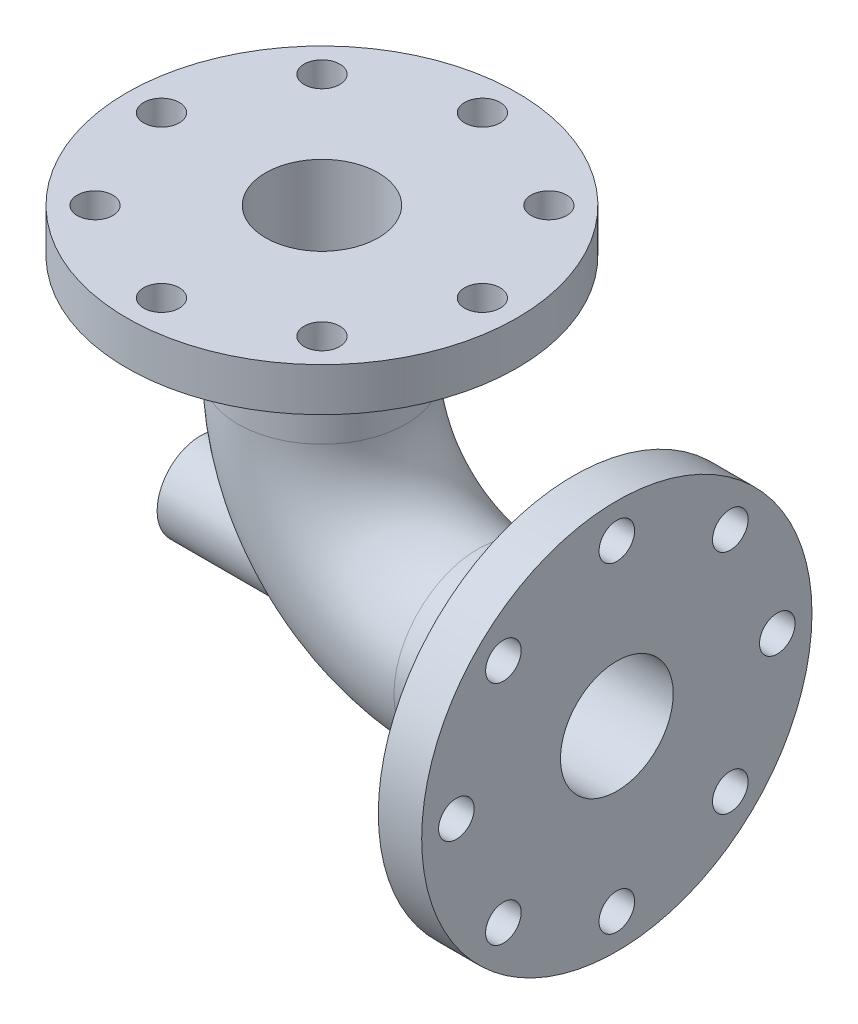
ISO-10303-21;
HEADER;
FILE_DESCRIPTION(('STEP AP214'),'2;1');
FILE_NAME('part.step','',(''),(''),'','','');
FILE_SCHEMA(('AUTOMOTIVE_DESIGN { 1 0 10303 214 1 1 1 1 }'));
ENDSEC;
DATA;
#1=APPLICATION_CONTEXT('core data for automotive mechanical design processes');
#2=APPLICATION_PROTOCOL_DEFINITION('international standard','automotive_design',2000,#1);
#3=PRODUCT_CONTEXT('',#1,'mechanical');
#4=PRODUCT('Part','Part','',(#3));
#5=PRODUCT_RELATED_PRODUCT_CATEGORY('part','',(#4));
#6=PRODUCT_DEFINITION_FORMATION('','',#4);
#7=PRODUCT_DEFINITION_CONTEXT('part definition',#1,'design');
#8=PRODUCT_DEFINITION('design','',#6,#7);
#9=PRODUCT_DEFINITION_SHAPE('','',#8);
#10=(LENGTH_UNIT() NAMED_UNIT(*) SI_UNIT(.MILLI.,.METRE.));
#11=(NAMED_UNIT(*) PLANE_ANGLE_UNIT() SI_UNIT($,.RADIAN.));
#12=(NAMED_UNIT(*) SI_UNIT($,.STERADIAN.) SOLID_ANGLE_UNIT());
#13=UNCERTAINTY_MEASURE_WITH_UNIT(LENGTH_MEASURE(1.E-05),#10,'distance_accuracy_value','');
#14=(GEOMETRIC_REPRESENTATION_CONTEXT(3) GLOBAL_UNCERTAINTY_ASSIGNED_CONTEXT((#13)) GLOBAL_UNIT_ASSIGNED_CONTEXT((#10,
#11,#12)) REPRESENTATION_CONTEXT('',''));
#15=CARTESIAN_POINT('',(0.,0.,0.));
#16=DIRECTION('',(0.,0.,1.));
#17=DIRECTION('',(1.,0.,0.));
#18=AXIS2_PLACEMENT_3D('',#15,#16,#17);
#19=CARTESIAN_POINT('',(0.,0.,0.));
#20=DIRECTION('',(0.,0.,1.));
#21=DIRECTION('',(1.,0.,0.));
#22=AXIS2_PLACEMENT_3D('',#19,#20,#21);
#23=TOROIDAL_SURFACE('',#22,90.,48.5);
#24=CARTESIAN_POINT('',(0.,-90.,0.));
#25=DIRECTION('',(-1.,0.,0.));
#26=DIRECTION('',(0.,0.,1.));
#27=AXIS2_PLACEMENT_3D('',#24,#25,#26);
#28=CIRCLE('',#27,48.5);
#29=CARTESIAN_POINT('',(0.,-90.,48.5));
#30=VERTEX_POINT('',#29);
#31=EDGE_CURVE('E58',#30,#30,#28,.T.);
#32=ORIENTED_EDGE('',*,*,#31,.T.);
#33=EDGE_LOOP('',(#32));
#34=FACE_BOUND('',#33,.T.);
#35=CARTESIAN_POINT('',(-90.,0.,0.));
#36=DIRECTION('',(0.,1.,0.));
#37=DIRECTION('',(0.,0.,1.));
#38=AXIS2_PLACEMENT_3D('',#35,#36,#37);
#39=CIRCLE('',#38,48.5);
#40=CARTESIAN_POINT('',(-90.,0.,48.5));
#41=VERTEX_POINT('',#40);
#42=EDGE_CURVE('E63',#41,#41,#39,.T.);
#43=ORIENTED_EDGE('',*,*,#42,.F.);
#44=EDGE_LOOP('',(#43));
#45=FACE_BOUND('',#44,.T.);
#46=CARTESIAN_POINT('',(-89.8449299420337,-96.875919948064,-24.035842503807));
#47=CARTESIAN_POINT('',(-89.282533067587,-97.5468685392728,-23.8439036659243));
#48=CARTESIAN_POINT('',(-88.7304253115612,-98.2179177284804,-23.621553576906));
#49=CARTESIAN_POINT('',(-87.6507002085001,-99.5556563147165,-23.1128027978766));
#50=CARTESIAN_POINT('',(-87.1230864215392,-100.222345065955,-22.8263928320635));
#51=CARTESIAN_POINT('',(-86.0965582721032,-101.545396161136,-22.186554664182));
#52=CARTESIAN_POINT('',(-85.5976305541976,-102.201763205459,-21.8331579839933));
#53=CARTESIAN_POINT('',(-84.8738989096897,-103.173123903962,-21.2511488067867));
#54=CARTESIAN_POINT('',(-84.6367783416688,-103.494693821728,-21.048506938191));
#55=CARTESIAN_POINT('',(-84.1711191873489,-104.132603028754,-20.6256153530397));
#56=CARTESIAN_POINT('',(-83.9425828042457,-104.448940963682,-20.4053611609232));
#57=CARTESIAN_POINT('',(-83.3555767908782,-105.269697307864,-19.804842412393));
#58=CARTESIAN_POINT('',(-83.0045200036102,-105.768962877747,-19.4101271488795));
#59=CARTESIAN_POINT('',(-82.3285995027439,-106.745583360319,-18.5741364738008));
#60=CARTESIAN_POINT('',(-82.0037307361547,-107.222942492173,-18.1328700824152));
#61=CARTESIAN_POINT('',(-81.3820615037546,-108.150413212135,-17.2044431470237));
#62=CARTESIAN_POINT('',(-81.0852548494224,-108.600530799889,-16.7172927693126));
#63=CARTESIAN_POINT('',(-80.5213707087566,-109.468010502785,-15.6985392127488));
#64=CARTESIAN_POINT('',(-80.2542937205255,-109.885372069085,-15.1669352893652));
#65=CARTESIAN_POINT('',(-79.7498574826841,-110.684098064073,-14.0583638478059));
#66=CARTESIAN_POINT('',(-79.5126893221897,-111.065227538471,-13.4811395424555));
#67=CARTESIAN_POINT('',(-79.0712894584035,-111.782983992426,-12.2876549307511));
#68=CARTESIAN_POINT('',(-78.8670584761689,-112.119609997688,-11.6713937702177));
#69=CARTESIAN_POINT('',(-78.4926410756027,-112.743040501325,-10.4044434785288));
#70=CARTESIAN_POINT('',(-78.3224466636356,-113.029856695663,-9.75376247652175));
#71=CARTESIAN_POINT('',(-78.0168742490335,-113.549091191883,-8.42319034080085));
#72=CARTESIAN_POINT('',(-77.8814922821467,-113.781515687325,-7.74330254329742));
#73=CARTESIAN_POINT('',(-77.6586541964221,-114.166479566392,-6.43398877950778));
#74=CARTESIAN_POINT('',(-77.567632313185,-114.324886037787,-5.80688626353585));
#75=CARTESIAN_POINT('',(-77.4141521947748,-114.593042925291,-4.53894506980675));
#76=CARTESIAN_POINT('',(-77.3516918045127,-114.702797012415,-3.89810743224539));
#77=CARTESIAN_POINT('',(-77.2555422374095,-114.872111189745,-2.60792644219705));
#78=CARTESIAN_POINT('',(-77.2218432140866,-114.931688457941,-1.95858607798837));
#79=CARTESIAN_POINT('',(-77.1832809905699,-114.999884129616,-0.656382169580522));
#80=CARTESIAN_POINT('',(-77.1784170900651,-115.00850377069,-0.00351871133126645));
#81=CARTESIAN_POINT('',(-77.1970068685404,-114.975609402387,1.26436086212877));
#82=CARTESIAN_POINT('',(-77.2189093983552,-114.936841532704,1.87947334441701));
#83=CARTESIAN_POINT('',(-77.2883974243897,-114.814218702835,3.10369888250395));
#84=CARTESIAN_POINT('',(-77.3359816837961,-114.730365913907,3.71281222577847));
#85=CARTESIAN_POINT('',(-77.4566949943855,-114.518622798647,4.92067552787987));
#86=CARTESIAN_POINT('',(-77.5298208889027,-114.390737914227,5.51942675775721));
#87=CARTESIAN_POINT('',(-77.7014100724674,-114.092490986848,6.70254179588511));
#88=CARTESIAN_POINT('',(-77.7998737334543,-113.922128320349,7.28690539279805));
#89=CARTESIAN_POINT('',(-78.0219992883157,-113.540702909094,8.43822266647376));
#90=CARTESIAN_POINT('',(-78.1456974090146,-113.3295816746,9.0051499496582));
#91=CARTESIAN_POINT('',(-78.4177997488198,-112.869297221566,10.1171822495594));
#92=CARTESIAN_POINT('',(-78.5662037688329,-112.620134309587,10.6622874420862));
#93=CARTESIAN_POINT('',(-78.8872148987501,-112.086610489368,11.7275979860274));
#94=CARTESIAN_POINT('',(-79.0598236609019,-111.802247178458,12.2478016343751));
#95=CARTESIAN_POINT('',(-79.4286014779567,-111.201485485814,13.2606082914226));
#96=CARTESIAN_POINT('',(-79.6247712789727,-110.885086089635,13.7532104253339));
#97=CARTESIAN_POINT('',(-80.0506281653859,-110.206525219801,14.7332842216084));
#98=CARTESIAN_POINT('',(-80.2815225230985,-109.84284476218,15.2191791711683));
#99=CARTESIAN_POINT('',(-80.7674875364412,-109.087789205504,16.1560616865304));
#100=CARTESIAN_POINT('',(-81.0225588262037,-108.696413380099,16.6070483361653));
#101=CARTESIAN_POINT('',(-81.5557232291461,-107.889965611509,17.4728118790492));
#102=CARTESIAN_POINT('',(-81.8338186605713,-107.474891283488,17.8875851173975));
#103=CARTESIAN_POINT('',(-82.4117279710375,-106.624980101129,18.6801434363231));
#104=CARTESIAN_POINT('',(-82.7115446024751,-106.19014074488,19.0579238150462));
#105=CARTESIAN_POINT('',(-83.3663653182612,-105.254621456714,19.8166313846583));
#106=CARTESIAN_POINT('',(-83.7237831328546,-104.752038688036,20.1931292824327));
#107=CARTESIAN_POINT('',(-84.4616847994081,-103.731847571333,20.9002792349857));
#108=CARTESIAN_POINT('',(-84.8421697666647,-103.214238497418,21.2309290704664));
#109=CARTESIAN_POINT('',(-85.6242935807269,-102.167970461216,21.8474119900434));
#110=CARTESIAN_POINT('',(-86.0259438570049,-101.639305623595,22.1332205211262));
#111=CARTESIAN_POINT('',(-86.8481657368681,-100.574784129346,22.6611342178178));
#112=CARTESIAN_POINT('',(-87.268740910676,-100.038926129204,22.9032310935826));
#113=CARTESIAN_POINT('',(-88.0215438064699,-99.095017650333,23.2910591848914));
#114=CARTESIAN_POINT('',(-88.3501870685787,-98.6878015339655,23.4458710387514));
#115=CARTESIAN_POINT('',(-89.0160615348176,-97.8723336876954,23.7321102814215));
#116=CARTESIAN_POINT('',(-89.3532913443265,-97.4640821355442,23.8635414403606));
#117=CARTESIAN_POINT('',(-90.3769650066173,-96.2388170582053,24.2240039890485));
#118=CARTESIAN_POINT('',(-91.0752340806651,-95.421492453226,24.4191236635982));
#119=CARTESIAN_POINT('',(-92.4973777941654,-93.791527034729,24.7247495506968));
#120=CARTESIAN_POINT('',(-93.2212904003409,-92.9788954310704,24.8351243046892));
#121=CARTESIAN_POINT('',(-94.6876879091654,-91.3637986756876,24.9759287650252));
#122=CARTESIAN_POINT('',(-95.4301709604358,-90.5613325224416,25.0063664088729));
#123=CARTESIAN_POINT('',(-96.9439834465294,-88.9526616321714,24.9912743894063));
#124=CARTESIAN_POINT('',(-97.7155908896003,-88.1467363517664,24.9441255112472));
#125=CARTESIAN_POINT('',(-99.2668088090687,-86.5507680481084,24.7739148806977));
#126=CARTESIAN_POINT('',(-100.04641968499,-85.7607258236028,24.6508493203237));
#127=CARTESIAN_POINT('',(-101.608315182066,-84.1983037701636,24.3305646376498));
#128=CARTESIAN_POINT('',(-102.390600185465,-83.4259265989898,24.1333344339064));
#129=CARTESIAN_POINT('',(-103.95225140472,-81.9008503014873,23.6651647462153));
#130=CARTESIAN_POINT('',(-104.731617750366,-81.1481502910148,23.3942285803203));
#131=CARTESIAN_POINT('',(-106.278537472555,-79.6676890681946,22.7790103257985));
#132=CARTESIAN_POINT('',(-107.046126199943,-78.9398381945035,22.4350337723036));
#133=CARTESIAN_POINT('',(-108.566567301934,-77.508717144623,21.6708553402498));
#134=CARTESIAN_POINT('',(-109.319417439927,-76.8054506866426,21.2506419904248));
#135=CARTESIAN_POINT('',(-110.801945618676,-75.4286836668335,20.3312856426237));
#136=CARTESIAN_POINT('',(-111.531651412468,-74.7551470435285,19.8322418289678));
#137=CARTESIAN_POINT('',(-112.959739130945,-73.4429670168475,18.7506565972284));
#138=CARTESIAN_POINT('',(-113.658136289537,-72.8043066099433,18.1681563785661));
#139=CARTESIAN_POINT('',(-114.776704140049,-71.7848842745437,17.1329552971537));
#140=CARTESIAN_POINT('',(-115.209129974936,-71.3917081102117,16.7056127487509));
#141=CARTESIAN_POINT('',(-116.052136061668,-70.6266106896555,15.8119500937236));
#142=CARTESIAN_POINT('',(-116.462717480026,-70.2546882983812,15.3456320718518));
#143=CARTESIAN_POINT('',(-117.256988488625,-69.5362369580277,14.3735588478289));
#144=CARTESIAN_POINT('',(-117.640713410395,-69.1896746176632,13.8678573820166));
#145=CARTESIAN_POINT('',(-118.376703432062,-68.5256972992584,12.815662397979));
#146=CARTESIAN_POINT('',(-118.728965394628,-68.2082852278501,12.2691648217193));
#147=CARTESIAN_POINT('',(-119.323014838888,-67.6734465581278,11.2594986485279));
#148=CARTESIAN_POINT('',(-119.572131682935,-67.4493195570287,10.8041833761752));
#149=CARTESIAN_POINT('',(-120.044050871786,-67.0249544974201,9.86967154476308));
#150=CARTESIAN_POINT('',(-120.266867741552,-66.8247032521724,9.39048837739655));
#151=CARTESIAN_POINT('',(-120.682901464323,-66.450944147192,8.40936763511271));
#152=CARTESIAN_POINT('',(-120.876121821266,-66.2774331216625,7.90743276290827));
#153=CARTESIAN_POINT('',(-121.229529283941,-65.9601608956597,6.88285373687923));
#154=CARTESIAN_POINT('',(-121.389716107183,-65.816399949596,6.36020940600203));
#155=CARTESIAN_POINT('',(-121.675149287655,-65.5602827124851,5.29195946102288));
#156=CARTESIAN_POINT('',(-121.800030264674,-65.4482548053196,4.74617651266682));
#157=CARTESIAN_POINT('',(-122.009707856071,-65.2601788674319,3.64080679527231));
#158=CARTESIAN_POINT('',(-122.094504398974,-65.1841309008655,3.08122000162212));
#159=CARTESIAN_POINT('',(-122.221733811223,-65.0700338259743,1.95384436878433));
#160=CARTESIAN_POINT('',(-122.264200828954,-65.031954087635,1.38606251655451));
#161=CARTESIAN_POINT('',(-122.305697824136,-64.9947440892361,0.247677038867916));
#162=CARTESIAN_POINT('',(-122.304734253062,-64.9956080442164,-0.32292615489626));
#163=CARTESIAN_POINT('',(-122.262873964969,-65.0331439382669,-1.37464340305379));
#164=CARTESIAN_POINT('',(-122.228051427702,-65.0643691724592,-1.85621388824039));
#165=CARTESIAN_POINT('',(-122.127908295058,-65.1541742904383,-2.81353825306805));
#166=CARTESIAN_POINT('',(-122.062591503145,-65.2127507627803,-3.28929285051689));
#167=CARTESIAN_POINT('',(-121.902696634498,-65.3561629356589,-4.23185779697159));
#168=CARTESIAN_POINT('',(-121.808115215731,-65.4410016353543,-4.6986671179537));
#169=CARTESIAN_POINT('',(-121.591374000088,-65.6354502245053,-5.62055947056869));
#170=CARTESIAN_POINT('',(-121.469212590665,-65.745061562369,-6.07564181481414));
#171=CARTESIAN_POINT('',(-121.197566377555,-65.9888572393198,-6.97753560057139));
#172=CARTESIAN_POINT('',(-121.047753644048,-66.123336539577,-7.4241680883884));
#173=CARTESIAN_POINT('',(-120.724114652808,-66.4139404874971,-8.30128669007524));
#174=CARTESIAN_POINT('',(-120.550289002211,-66.5700645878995,-8.73177321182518));
#175=CARTESIAN_POINT('',(-119.996130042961,-67.0679852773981,-9.99720214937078));
#176=CARTESIAN_POINT('',(-119.583049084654,-67.4393891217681,-10.8063262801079));
#177=CARTESIAN_POINT('',(-118.423015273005,-68.4836581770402,-12.8048196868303));
#178=CARTESIAN_POINT('',(-117.622625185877,-69.2053193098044,-13.9378008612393));
#179=CARTESIAN_POINT('',(-116.332954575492,-70.3721724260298,-15.4975033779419));
#180=CARTESIAN_POINT('',(-115.887374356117,-70.7759502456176,-15.9948427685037));
#181=CARTESIAN_POINT('',(-114.971382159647,-71.6077886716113,-16.9447519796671));
#182=CARTESIAN_POINT('',(-114.500970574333,-72.0358488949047,-17.3973225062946));
#183=CARTESIAN_POINT('',(-113.670679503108,-72.7933896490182,-18.1420261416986));
#184=CARTESIAN_POINT('',(-113.315462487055,-73.1180842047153,-18.4443598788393));
#185=CARTESIAN_POINT('',(-112.595911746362,-73.777264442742,-19.0267230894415));
#186=CARTESIAN_POINT('',(-112.231577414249,-74.1117507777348,-19.3067510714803));
#187=CARTESIAN_POINT('',(-111.126750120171,-75.1286336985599,-20.1144870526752));
#188=CARTESIAN_POINT('',(-110.374556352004,-75.8243417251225,-20.6097376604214));
#189=CARTESIAN_POINT('',(-108.847730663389,-77.2457590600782,-21.5184064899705));
#190=CARTESIAN_POINT('',(-108.073070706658,-77.9715063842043,-21.931716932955));
#191=CARTESIAN_POINT('',(-106.509829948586,-79.4480112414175,-22.679064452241));
#192=CARTESIAN_POINT('',(-105.721251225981,-80.1987650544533,-23.0131132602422));
#193=CARTESIAN_POINT('',(-104.107386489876,-81.7505320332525,-23.6149152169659));
#194=CARTESIAN_POINT('',(-103.281820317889,-82.552377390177,-23.8797646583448));
#195=CARTESIAN_POINT('',(-101.629223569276,-84.1774831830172,-24.3271165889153));
#196=CARTESIAN_POINT('',(-100.802192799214,-85.0007466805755,-24.5096072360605));
#197=CARTESIAN_POINT('',(-99.1549972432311,-86.6645875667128,-24.7908324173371));
#198=CARTESIAN_POINT('',(-98.3348214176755,-87.505123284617,-24.8897487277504));
#199=CARTESIAN_POINT('',(-96.7061053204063,-89.2027650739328,-25.0017535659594));
#200=CARTESIAN_POINT('',(-95.8975610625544,-90.0598652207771,-25.0148722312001));
#201=CARTESIAN_POINT('',(-94.6452991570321,-91.4131242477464,-24.9648320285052));
#202=CARTESIAN_POINT('',(-94.195301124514,-91.9047642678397,-24.9322603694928));
#203=CARTESIAN_POINT('',(-93.302486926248,-92.8916216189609,-24.8371547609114));
#204=CARTESIAN_POINT('',(-92.8596699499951,-93.3868385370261,-24.7746242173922));
#205=CARTESIAN_POINT('',(-91.9822842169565,-94.3802493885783,-24.6184152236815));
#206=CARTESIAN_POINT('',(-91.547720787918,-94.878444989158,-24.5247173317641));
#207=CARTESIAN_POINT('',(-90.6885106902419,-95.8763816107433,-24.3049222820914));
#208=CARTESIAN_POINT('',(-90.2638656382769,-96.3761228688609,-24.1788198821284));
#209=CARTESIAN_POINT('',(-89.8449299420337,-96.875919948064,-24.035842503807));
#210=B_SPLINE_CURVE_WITH_KNOTS('',3,(#46,#47,#48,#49,#50,#51,#52,#53,#54,#55,#56,#57,#58,#59,
#60,#61,#62,#63,#64,#65,#66,#67,#68,#69,#70,#71,#72,#73,#74,#75,#76,#77,#78,#79,#80,#81,#82,#83,
#84,#85,#86,#87,#88,#89,#90,#91,#92,#93,#94,#95,#96,#97,#98,#99,#100,#101,#102,#103,#104,#105,
#106,#107,#108,#109,#110,#111,#112,#113,#114,#115,#116,#117,#118,#119,#120,#121,#122,#123,#124,
#125,#126,#127,#128,#129,#130,#131,#132,#133,#134,#135,#136,#137,#138,#139,#140,#141,#142,#143,
#144,#145,#146,#147,#148,#149,#150,#151,#152,#153,#154,#155,#156,#157,#158,#159,#160,#161,#162,
#163,#164,#165,#166,#167,#168,#169,#170,#171,#172,#173,#174,#175,#176,#177,#178,#179,#180,#181,
#182,#183,#184,#185,#186,#187,#188,#189,#190,#191,#192,#193,#194,#195,#196,#197,#198,#199,#200,
#201,#202,#203,#204,#205,#206,#207,#208,#209),.UNSPECIFIED.,.T.,.F.,(4,2,2,2,2,2,2,2,2,2,2,2,2,
2,2,2,2,2,2,2,2,2,2,2,2,2,2,2,2,2,2,2,2,2,2,2,2,2,2,2,2,2,2,2,2,2,2,2,2,2,2,2,2,2,2,2,2,2,2,2,2,
2,2,2,2,2,2,2,2,2,2,2,2,2,2,2,2,2,2,2,2,4),(0.,2.6883601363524,5.37710979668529,
8.06459734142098,9.40818183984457,10.75210885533,12.9303384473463,15.1081467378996,
17.2854736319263,19.4628370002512,21.6534738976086,23.8441587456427,26.0343284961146,
28.2242487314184,30.1812636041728,32.138130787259,34.0943277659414,36.0504772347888,
37.8984473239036,39.7463284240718,41.5939812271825,43.4416611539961,45.2920125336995,
47.1423490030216,48.9928118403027,50.8433332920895,52.7893548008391,54.735427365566,
56.6816961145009,58.6282119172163,60.7937589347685,62.9594107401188,65.1262442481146,
67.2934882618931,68.9300418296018,70.5663312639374,73.8397097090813,77.1181557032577,
80.3962761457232,83.7436817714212,87.0912553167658,90.4393292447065,93.787252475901,
97.121437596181,100.456124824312,103.786649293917,107.115535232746,109.286145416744,
111.456639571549,113.624222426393,115.792021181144,117.486578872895,119.180196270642,
120.873613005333,122.567044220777,124.277407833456,125.987774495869,127.696760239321,
129.405492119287,130.855258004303,132.304843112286,133.75459382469,135.204429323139,
136.672715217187,138.140963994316,141.07677831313,145.73999390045,148.07965349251,
150.419276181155,152.123742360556,153.828322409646,157.238079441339,160.652292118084,
164.06599913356,167.605767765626,171.146045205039,174.678602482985,178.209918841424,
180.211161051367,182.212175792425,184.214441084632,186.217030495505),.UNSPECIFIED.);
#211=CARTESIAN_POINT('',(-89.8449299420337,-96.875919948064,-24.035842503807));
#212=VERTEX_POINT('',#211);
#213=EDGE_CURVE('E11',#212,#212,#210,.T.);
#214=ORIENTED_EDGE('',*,*,#213,.F.);
#215=EDGE_LOOP('',(#214));
#216=FACE_BOUND('',#215,.T.);
#217=ADVANCED_FACE('F42',(#34,#45,#216),#23,.T.);
#218=CARTESIAN_POINT('',(-90.,85.,0.));
#219=DIRECTION('',(0.,-1.,0.));
#220=DIRECTION('',(1.,0.,0.));
#221=AXIS2_PLACEMENT_3D('',#218,#219,#220);
#222=CYLINDRICAL_SURFACE('',#221,48.5);
#223=ORIENTED_EDGE('',*,*,#42,.T.);
#224=EDGE_LOOP('',(#223));
#225=FACE_BOUND('',#224,.T.);
#226=CARTESIAN_POINT('',(-90.,60.,0.));
#227=DIRECTION('',(0.,1.,0.));
#228=DIRECTION('',(-1.,0.,0.));
#229=AXIS2_PLACEMENT_3D('',#226,#227,#228);
#230=CIRCLE('',#229,48.5);
#231=CARTESIAN_POINT('',(-138.5,60.,0.));
#232=VERTEX_POINT('',#231);
#233=EDGE_CURVE('E54',#232,#232,#230,.T.);
#234=ORIENTED_EDGE('',*,*,#233,.F.);
#235=EDGE_LOOP('',(#234));
#236=FACE_BOUND('',#235,.T.);
#237=ADVANCED_FACE('F118',(#225,#236),#222,.T.);
#238=CARTESIAN_POINT('',(-90.,85.,0.));
#239=DIRECTION('',(0.,1.,0.));
#240=DIRECTION('',(0.,0.,1.));
#241=AXIS2_PLACEMENT_3D('',#238,#239,#240);
#242=PLANE('',#241);
#243=CARTESIAN_POINT('',(-90.0000000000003,85.,-92.5));
#244=DIRECTION('',(0.,1.,0.));
#245=DIRECTION('',(0.,0.,1.));
#246=AXIS2_PLACEMENT_3D('',#243,#244,#245);
#247=CIRCLE('',#246,10.25);
#248=CARTESIAN_POINT('',(-90.0000000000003,85.,-82.25));
#249=VERTEX_POINT('',#248);
#250=EDGE_CURVE('E373',#249,#249,#247,.T.);
#251=ORIENTED_EDGE('',*,*,#250,.F.);
#252=EDGE_LOOP('',(#251));
#253=FACE_BOUND('',#252,.T.);
#254=CARTESIAN_POINT('',(-155.407377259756,85.,-65.4073772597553));
#255=DIRECTION('',(0.,1.,0.));
#256=DIRECTION('',(0.707106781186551,0.,0.707106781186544));
#257=AXIS2_PLACEMENT_3D('',#254,#255,#256);
#258=CIRCLE('',#257,10.25);
#259=CARTESIAN_POINT('',(-148.159532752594,85.,-58.1595327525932));
#260=VERTEX_POINT('',#259);
#261=EDGE_CURVE('E367',#260,#260,#258,.T.);
#262=ORIENTED_EDGE('',*,*,#261,.F.);
#263=EDGE_LOOP('',(#262));
#264=FACE_BOUND('',#263,.T.);
#265=CARTESIAN_POINT('',(-182.5,85.,0.));
#266=DIRECTION('',(0.,1.,0.));
#267=DIRECTION('',(1.,0.,0.));
#268=AXIS2_PLACEMENT_3D('',#265,#266,#267);
#269=CIRCLE('',#268,10.25);
#270=CARTESIAN_POINT('',(-172.25,85.,0.));
#271=VERTEX_POINT('',#270);
#272=EDGE_CURVE('E359',#271,#271,#269,.T.);
#273=ORIENTED_EDGE('',*,*,#272,.F.);
#274=EDGE_LOOP('',(#273));
#275=FACE_BOUND('',#274,.T.);
#276=CARTESIAN_POINT('',(-155.407377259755,85.,65.4073772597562));
#277=DIRECTION('',(0.,1.,0.));
#278=DIRECTION('',(0.707106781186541,0.,-0.707106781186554));
#279=AXIS2_PLACEMENT_3D('',#276,#277,#278);
#280=CIRCLE('',#279,10.25);
#281=CARTESIAN_POINT('',(-148.159532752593,85.,58.159532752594));
#282=VERTEX_POINT('',#281);
#283=EDGE_CURVE('E360',#282,#282,#280,.T.);
#284=ORIENTED_EDGE('',*,*,#283,.F.);
#285=EDGE_LOOP('',(#284));
#286=FACE_BOUND('',#285,.T.);
#287=CARTESIAN_POINT('',(-89.999999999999,85.,92.5));
#288=DIRECTION('',(0.,1.,0.));
#289=DIRECTION('',(0.,0.,-1.));
#290=AXIS2_PLACEMENT_3D('',#287,#288,#289);
#291=CIRCLE('',#290,10.25);
#292=CARTESIAN_POINT('',(-89.9999999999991,85.,82.25));
#293=VERTEX_POINT('',#292);
#294=EDGE_CURVE('E382',#293,#293,#291,.T.);
#295=ORIENTED_EDGE('',*,*,#294,.F.);
#296=EDGE_LOOP('',(#295));
#297=FACE_BOUND('',#296,.T.);
#298=CARTESIAN_POINT('',(-24.5926227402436,85.,65.4073772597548));
#299=DIRECTION('',(0.,1.,0.));
#300=DIRECTION('',(-0.707106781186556,0.,-0.707106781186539));
#301=AXIS2_PLACEMENT_3D('',#298,#299,#300);
#302=CIRCLE('',#301,10.25);
#303=CARTESIAN_POINT('',(-31.8404672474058,85.,58.1595327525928));
#304=VERTEX_POINT('',#303);
#305=EDGE_CURVE('E170',#304,#304,#302,.T.);
#306=ORIENTED_EDGE('',*,*,#305,.F.);
#307=EDGE_LOOP('',(#306));
#308=FACE_BOUND('',#307,.T.);
#309=CARTESIAN_POINT('',(-24.5926227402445,85.,-65.4073772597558));
#310=DIRECTION('',(0.,1.,0.));
#311=DIRECTION('',(-0.707106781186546,0.,0.707106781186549));
#312=AXIS2_PLACEMENT_3D('',#309,#310,#311);
#313=CIRCLE('',#312,10.25);
#314=CARTESIAN_POINT('',(-31.8404672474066,85.,-58.1595327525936));
#315=VERTEX_POINT('',#314);
#316=EDGE_CURVE('E352',#315,#315,#313,.T.);
#317=ORIENTED_EDGE('',*,*,#316,.F.);
#318=EDGE_LOOP('',(#317));
#319=FACE_BOUND('',#318,.T.);
#320=CARTESIAN_POINT('',(2.49999999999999,85.,0.));
#321=DIRECTION('',(0.,1.,0.));
#322=DIRECTION('',(-1.,0.,0.));
#323=AXIS2_PLACEMENT_3D('',#320,#321,#322);
#324=CIRCLE('',#323,10.25);
#325=CARTESIAN_POINT('',(-7.75000000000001,85.,0.));
#326=VERTEX_POINT('',#325);
#327=EDGE_CURVE('E339',#326,#326,#324,.T.);
#328=ORIENTED_EDGE('',*,*,#327,.F.);
#329=EDGE_LOOP('',(#328));
#330=FACE_BOUND('',#329,.T.);
#331=CARTESIAN_POINT('',(-90.,85.,0.));
#332=DIRECTION('',(0.,1.,0.));
#333=DIRECTION('',(-1.,0.,0.));
#334=AXIS2_PLACEMENT_3D('',#331,#332,#333);
#335=CIRCLE('',#334,32.5);
#336=CARTESIAN_POINT('',(-122.5,85.,0.));
#337=VERTEX_POINT('',#336);
#338=EDGE_CURVE('E84',#337,#337,#335,.T.);
#339=ORIENTED_EDGE('',*,*,#338,.F.);
#340=EDGE_LOOP('',(#339));
#341=FACE_BOUND('',#340,.T.);
#342=CARTESIAN_POINT('',(-90.,85.,0.));
#343=DIRECTION('',(0.,1.,0.));
#344=DIRECTION('',(-1.,0.,0.));
#345=AXIS2_PLACEMENT_3D('',#342,#343,#344);
#346=CIRCLE('',#345,112.5);
#347=CARTESIAN_POINT('',(-202.5,84.9999999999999,0.));
#348=VERTEX_POINT('',#347);
#349=EDGE_CURVE('E67',#348,#348,#346,.T.);
#350=ORIENTED_EDGE('',*,*,#349,.T.);
#351=EDGE_LOOP('',(#350));
#352=FACE_BOUND('',#351,.T.);
#353=ADVANCED_FACE('F44',(#253,#264,#275,#286,#297,#308,#319,#330,#341,#352),#242,.T.);
#354=CARTESIAN_POINT('',(0.,-90.,0.));
#355=DIRECTION('',(1.,0.,0.));
#356=DIRECTION('',(0.,0.,-1.));
#357=AXIS2_PLACEMENT_3D('',#354,#355,#356);
#358=CYLINDRICAL_SURFACE('',#357,48.5);
#359=CARTESIAN_POINT('',(55.,-90.,0.));
#360=DIRECTION('',(-1.,0.,0.));
#361=DIRECTION('',(0.,0.,1.));
#362=AXIS2_PLACEMENT_3D('',#359,#360,#361);
#363=CIRCLE('',#362,48.5);
#364=CARTESIAN_POINT('',(55.,-90.,48.5));
#365=VERTEX_POINT('',#364);
#366=EDGE_CURVE('E77',#365,#365,#363,.T.);
#367=ORIENTED_EDGE('',*,*,#366,.T.);
#368=EDGE_LOOP('',(#367));
#369=FACE_BOUND('',#368,.T.);
#370=ORIENTED_EDGE('',*,*,#31,.F.);
#371=EDGE_LOOP('',(#370));
#372=FACE_BOUND('',#371,.T.);
#373=ADVANCED_FACE('F93',(#369,#372),#358,.T.);
#374=CARTESIAN_POINT('',(-90.,85.,0.));
#375=DIRECTION('',(0.,-1.,0.));
#376=DIRECTION('',(1.,0.,0.));
#377=AXIS2_PLACEMENT_3D('',#374,#375,#376);
#378=CYLINDRICAL_SURFACE('',#377,32.5);
#379=ORIENTED_EDGE('',*,*,#338,.T.);
#380=EDGE_LOOP('',(#379));
#381=FACE_BOUND('',#380,.T.);
#382=CARTESIAN_POINT('',(-90.,0.,0.));
#383=DIRECTION('',(0.,-1.,0.));
#384=DIRECTION('',(1.,0.,0.));
#385=AXIS2_PLACEMENT_3D('',#382,#383,#384);
#386=CIRCLE('',#385,32.5);
#387=CARTESIAN_POINT('',(-57.5,0.,0.));
#388=VERTEX_POINT('',#387);
#389=EDGE_CURVE('E80',#388,#388,#386,.F.);
#390=ORIENTED_EDGE('',*,*,#389,.F.);
#391=EDGE_LOOP('',(#390));
#392=FACE_BOUND('',#391,.T.);
#393=ADVANCED_FACE('F129',(#381,#392),#378,.F.);
#394=CARTESIAN_POINT('',(0.,0.,0.));
#395=DIRECTION('',(0.,0.,1.));
#396=DIRECTION('',(1.,0.,0.));
#397=AXIS2_PLACEMENT_3D('',#394,#395,#396);
#398=TOROIDAL_SURFACE('',#397,90.,32.5);
#399=CARTESIAN_POINT('',(-91.5550325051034,-80.9612495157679,-4.27796560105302));
#400=CARTESIAN_POINT('',(-91.7414521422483,-80.8131570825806,-3.96503310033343));
#401=CARTESIAN_POINT('',(-91.9124105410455,-80.677630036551,-3.63661544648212));
#402=CARTESIAN_POINT('',(-92.1389806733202,-80.4982489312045,-3.12246576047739));
#403=CARTESIAN_POINT('',(-92.2095625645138,-80.4424114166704,-2.947373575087));
#404=CARTESIAN_POINT('',(-92.339586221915,-80.3396076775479,-2.59060529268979));
#405=CARTESIAN_POINT('',(-92.3990327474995,-80.2926376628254,-2.40893204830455));
#406=CARTESIAN_POINT('',(-92.5061390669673,-80.2080480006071,-2.03817298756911));
#407=CARTESIAN_POINT('',(-92.5536900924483,-80.1705146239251,-1.84903586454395));
#408=CARTESIAN_POINT('',(-92.6352659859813,-80.1061446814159,-1.46605566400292));
#409=CARTESIAN_POINT('',(-92.6692908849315,-80.0793080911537,-1.27221259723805));
#410=CARTESIAN_POINT('',(-92.7229532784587,-80.0369903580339,-0.88148484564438));
#411=CARTESIAN_POINT('',(-92.7426036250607,-80.0214990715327,-0.684603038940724));
#412=CARTESIAN_POINT('',(-92.7670474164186,-80.0022297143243,-0.289351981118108));
#413=CARTESIAN_POINT('',(-92.771842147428,-79.9984506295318,-0.090982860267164));
#414=CARTESIAN_POINT('',(-92.7666868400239,-80.0025143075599,0.288188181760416));
#415=CARTESIAN_POINT('',(-92.7579811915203,-80.0093762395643,0.469019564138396));
#416=CARTESIAN_POINT('',(-92.7282806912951,-80.0327911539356,0.829024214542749));
#417=CARTESIAN_POINT('',(-92.7072865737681,-80.0493435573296,1.00819758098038));
#418=CARTESIAN_POINT('',(-92.653454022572,-80.0917995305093,1.36367976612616));
#419=CARTESIAN_POINT('',(-92.6206116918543,-80.1177061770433,1.53998762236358));
#420=CARTESIAN_POINT('',(-92.5437465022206,-80.1783635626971,1.88858821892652));
#421=CARTESIAN_POINT('',(-92.4997231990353,-80.2131146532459,2.06088079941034));
#422=CARTESIAN_POINT('',(-92.4014727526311,-80.2907110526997,2.39996982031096));
#423=CARTESIAN_POINT('',(-92.3472815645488,-80.3335278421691,2.56678326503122));
#424=CARTESIAN_POINT('',(-92.2294627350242,-80.4266736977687,2.89491566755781));
#425=CARTESIAN_POINT('',(-92.1658321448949,-80.4770051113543,3.05623288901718));
#426=CARTESIAN_POINT('',(-91.9621636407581,-80.6382181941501,3.531107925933));
#427=CARTESIAN_POINT('',(-91.8093037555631,-80.7593543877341,3.83574073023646));
#428=CARTESIAN_POINT('',(-91.3697772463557,-81.1083098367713,4.60585715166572));
#429=CARTESIAN_POINT('',(-91.0600288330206,-81.3548333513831,5.0497185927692));
#430=CARTESIAN_POINT('',(-90.5587822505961,-81.7553747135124,5.66447943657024));
#431=CARTESIAN_POINT('',(-90.3852506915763,-81.8942922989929,5.8612021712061));
#432=CARTESIAN_POINT('',(-90.0279841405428,-82.1809099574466,6.23841835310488));
#433=CARTESIAN_POINT('',(-89.8442494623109,-82.3286097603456,6.41891229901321));
#434=CARTESIAN_POINT('',(-89.3667849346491,-82.7133411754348,6.857846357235));
#435=CARTESIAN_POINT('',(-89.0673390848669,-82.9554598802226,7.10560740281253));
#436=CARTESIAN_POINT('',(-88.453919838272,-83.4535291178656,7.56696633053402));
#437=CARTESIAN_POINT('',(-88.1399387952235,-83.7094869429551,7.78054596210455));
#438=CARTESIAN_POINT('',(-87.5009220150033,-84.2328730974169,8.17606140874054));
#439=CARTESIAN_POINT('',(-87.1758706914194,-84.5003177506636,8.35795019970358));
#440=CARTESIAN_POINT('',(-86.5181570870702,-85.0443117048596,8.691543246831));
#441=CARTESIAN_POINT('',(-86.1854953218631,-85.3208603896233,8.84324954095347));
#442=CARTESIAN_POINT('',(-85.3921827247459,-85.9841801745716,9.1681571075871));
#443=CARTESIAN_POINT('',(-84.9292031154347,-86.3742846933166,9.32893988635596));
#444=CARTESIAN_POINT('',(-83.9979576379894,-87.1659972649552,9.59913563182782));
#445=CARTESIAN_POINT('',(-83.5296897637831,-87.5676097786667,9.70852838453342));
#446=CARTESIAN_POINT('',(-82.5918579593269,-88.3800148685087,9.8766255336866));
#447=CARTESIAN_POINT('',(-82.1222937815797,-88.7908093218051,9.93531946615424));
#448=CARTESIAN_POINT('',(-81.1857480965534,-89.6192190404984,10.0013801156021));
#449=CARTESIAN_POINT('',(-80.718765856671,-90.0368322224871,10.0087622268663));
#450=CARTESIAN_POINT('',(-79.8719324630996,-90.8032874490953,9.97371978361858));
#451=CARTESIAN_POINT('',(-79.4910836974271,-91.151426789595,9.93975362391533));
#452=CARTESIAN_POINT('',(-78.7358576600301,-91.8491099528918,9.8338848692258));
#453=CARTESIAN_POINT('',(-78.3614806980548,-92.1986538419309,9.76198046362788));
#454=CARTESIAN_POINT('',(-77.6224981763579,-92.89632442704,9.57816422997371));
#455=CARTESIAN_POINT('',(-77.2578769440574,-93.2444525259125,9.46632130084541));
#456=CARTESIAN_POINT('',(-76.540904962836,-93.9369366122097,9.19989551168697));
#457=CARTESIAN_POINT('',(-76.1885493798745,-94.2812940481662,9.04532970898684));
#458=CARTESIAN_POINT('',(-75.6058395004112,-94.8575254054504,8.74500356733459));
#459=CARTESIAN_POINT('',(-75.3712999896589,-95.0914134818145,8.61116232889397));
#460=CARTESIAN_POINT('',(-74.9113667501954,-95.5538590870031,8.32041089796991));
#461=CARTESIAN_POINT('',(-74.685972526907,-95.7824169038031,8.16350195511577));
#462=CARTESIAN_POINT('',(-74.2463207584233,-96.231900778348,7.82574977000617));
#463=CARTESIAN_POINT('',(-74.0320515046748,-96.4528347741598,7.64493243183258));
#464=CARTESIAN_POINT('',(-73.6163664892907,-96.8848915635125,7.25825703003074));
#465=CARTESIAN_POINT('',(-73.4149521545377,-97.0960132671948,7.05239619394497));
#466=CARTESIAN_POINT('',(-73.0703670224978,-97.4599873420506,6.66355261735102));
#467=CARTESIAN_POINT('',(-72.9241819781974,-97.6153827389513,6.48561307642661));
#468=CARTESIAN_POINT('',(-72.6423167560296,-97.9167288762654,6.11412933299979));
#469=CARTESIAN_POINT('',(-72.5066340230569,-98.0626819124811,5.92058894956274));
#470=CARTESIAN_POINT('',(-72.2472006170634,-98.3432541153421,5.51817248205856));
#471=CARTESIAN_POINT('',(-72.1234405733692,-98.4778821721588,5.30930867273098));
#472=CARTESIAN_POINT('',(-71.8891830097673,-98.7339622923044,4.87658402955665));
#473=CARTESIAN_POINT('',(-71.7786833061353,-98.8554165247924,4.65272567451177));
#474=CARTESIAN_POINT('',(-71.5897596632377,-99.0639704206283,4.22969713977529));
#475=CARTESIAN_POINT('',(-71.5090653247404,-99.1534142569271,4.03269337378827));
#476=CARTESIAN_POINT('',(-71.3587499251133,-99.3205599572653,3.62970029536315));
#477=CARTESIAN_POINT('',(-71.2891267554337,-99.3982640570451,3.42371270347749));
#478=CARTESIAN_POINT('',(-71.1617786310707,-99.5407741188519,3.00379326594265));
#479=CARTESIAN_POINT('',(-71.1040507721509,-99.6055832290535,2.7898633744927));
#480=CARTESIAN_POINT('',(-71.0012175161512,-99.7212748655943,2.35528542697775));
#481=CARTESIAN_POINT('',(-70.956112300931,-99.7721571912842,2.13463727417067));
#482=CARTESIAN_POINT('',(-70.8789697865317,-99.8593111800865,1.68707055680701));
#483=CARTESIAN_POINT('',(-70.8469969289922,-99.8955107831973,1.46012677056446));
#484=CARTESIAN_POINT('',(-70.7969136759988,-99.9522637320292,1.00276721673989));
#485=CARTESIAN_POINT('',(-70.7788033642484,-99.9728169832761,0.772351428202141));
#486=CARTESIAN_POINT('',(-70.7567291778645,-99.9978735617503,0.310015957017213));
#487=CARTESIAN_POINT('',(-70.7527625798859,-100.002379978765,0.0780965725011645));
#488=CARTESIAN_POINT('',(-70.7590321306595,-99.9952606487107,-0.385292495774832));
#489=CARTESIAN_POINT('',(-70.7692674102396,-99.9836358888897,-0.616762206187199));
#490=CARTESIAN_POINT('',(-70.8023603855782,-99.9460942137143,-1.0584133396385));
#491=CARTESIAN_POINT('',(-70.82411580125,-99.9214256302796,-1.26878583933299));
#492=CARTESIAN_POINT('',(-70.8791733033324,-99.859094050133,-1.68604768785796));
#493=CARTESIAN_POINT('',(-70.9124746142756,-99.8214319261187,-1.89293726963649));
#494=CARTESIAN_POINT('',(-70.9902035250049,-99.7337077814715,-2.30188227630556));
#495=CARTESIAN_POINT('',(-71.0346288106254,-99.6836483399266,-2.50393869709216));
#496=CARTESIAN_POINT('',(-71.1341078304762,-99.5718402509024,-2.90218367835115));
#497=CARTESIAN_POINT('',(-71.1891655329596,-99.510087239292,-3.09837001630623));
#498=CARTESIAN_POINT('',(-71.3113553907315,-99.3734492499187,-3.4904157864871));
#499=CARTESIAN_POINT('',(-71.3788357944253,-99.2981877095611,-3.68603506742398));
#500=CARTESIAN_POINT('',(-71.5238232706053,-99.1370515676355,-4.06908922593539));
#501=CARTESIAN_POINT('',(-71.6013342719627,-99.0511728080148,-4.2565208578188));
#502=CARTESIAN_POINT('',(-71.7656278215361,-98.8698509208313,-4.62249420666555));
#503=CARTESIAN_POINT('',(-71.8524113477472,-98.7744067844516,-4.80103498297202));
#504=CARTESIAN_POINT('',(-72.0345044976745,-98.5749826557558,-5.14877335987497));
#505=CARTESIAN_POINT('',(-72.1298158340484,-98.4710009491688,-5.31796907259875));
#506=CARTESIAN_POINT('',(-72.3718788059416,-98.2080990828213,-5.71901765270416));
#507=CARTESIAN_POINT('',(-72.5228214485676,-98.0451260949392,-5.94570877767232));
#508=CARTESIAN_POINT('',(-72.8388177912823,-97.7063179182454,-6.37873893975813));
#509=CARTESIAN_POINT('',(-73.003876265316,-97.5304783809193,-6.58507104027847));
#510=CARTESIAN_POINT('',(-73.3464848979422,-97.1681353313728,-6.97777361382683));
#511=CARTESIAN_POINT('',(-73.5240550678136,-96.981614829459,-7.16411084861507));
#512=CARTESIAN_POINT('',(-73.8897485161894,-96.6003423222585,-7.51684415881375));
#513=CARTESIAN_POINT('',(-74.077872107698,-96.4055900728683,-7.68323964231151));
#514=CARTESIAN_POINT('',(-74.5356724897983,-95.9352277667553,-8.05566856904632));
#515=CARTESIAN_POINT('',(-74.8094227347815,-95.6567423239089,-8.25308956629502));
#516=CARTESIAN_POINT('',(-75.3708606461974,-95.0915363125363,-8.613282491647));
#517=CARTESIAN_POINT('',(-75.6585533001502,-94.804812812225,-8.77604190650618));
#518=CARTESIAN_POINT('',(-76.2454099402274,-94.225913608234,-9.0690128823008));
#519=CARTESIAN_POINT('',(-76.5445857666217,-93.9337324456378,-9.19918974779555));
#520=CARTESIAN_POINT('',(-77.1518087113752,-93.3466011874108,-9.42865881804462));
#521=CARTESIAN_POINT('',(-77.4598558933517,-93.0516510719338,-9.52795080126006));
#522=CARTESIAN_POINT('',(-78.1948580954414,-92.3546398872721,-9.72780773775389));
#523=CARTESIAN_POINT('',(-78.6247891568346,-91.9521501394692,-9.81602568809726));
#524=CARTESIAN_POINT('',(-79.4935251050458,-91.1487877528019,-9.94211653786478));
#525=CARTESIAN_POINT('',(-79.9323331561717,-90.7479157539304,-9.97997115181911));
#526=CARTESIAN_POINT('',(-80.8159602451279,-89.9497877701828,-10.0078553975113));
#527=CARTESIAN_POINT('',(-81.2607878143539,-89.5525386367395,-9.99780802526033));
#528=CARTESIAN_POINT('',(-82.1524823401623,-88.7644498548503,-9.93125297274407));
#529=CARTESIAN_POINT('',(-82.5993489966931,-88.3736092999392,-9.87475192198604));
#530=CARTESIAN_POINT('',(-83.4996234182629,-87.593572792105,-9.71443961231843));
#531=CARTESIAN_POINT('',(-83.953013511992,-87.2045172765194,-9.60984185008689));
#532=CARTESIAN_POINT('',(-84.855233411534,-86.4368994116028,-9.35244752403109));
#533=CARTESIAN_POINT('',(-85.3040618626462,-86.0583401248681,-9.19963705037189));
#534=CARTESIAN_POINT('',(-86.1923259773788,-85.3147690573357,-8.8441085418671));
#535=CARTESIAN_POINT('',(-86.6317731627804,-84.9497401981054,-8.64145607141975));
#536=CARTESIAN_POINT('',(-87.2798806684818,-84.41489402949,-8.29767416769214));
#537=CARTESIAN_POINT('',(-87.4940324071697,-84.2387608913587,-8.17647353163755));
#538=CARTESIAN_POINT('',(-87.9178395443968,-83.8912565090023,-7.92021908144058));
#539=CARTESIAN_POINT('',(-88.1274956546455,-83.7198845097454,-7.78516747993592));
#540=CARTESIAN_POINT('',(-88.5747577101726,-83.3553243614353,-7.47756652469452));
#541=CARTESIAN_POINT('',(-88.8114061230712,-83.1630853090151,-7.30248421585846));
#542=CARTESIAN_POINT('',(-89.2753177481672,-82.7873411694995,-6.93161160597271));
#543=CARTESIAN_POINT('',(-89.5025806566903,-82.6038363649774,-6.7358206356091));
#544=CARTESIAN_POINT('',(-89.9442288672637,-82.2481612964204,-6.32320025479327));
#545=CARTESIAN_POINT('',(-90.1586668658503,-82.0759443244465,-6.10646811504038));
#546=CARTESIAN_POINT('',(-90.5724704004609,-81.7443772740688,-5.6501473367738));
#547=CARTESIAN_POINT('',(-90.7718446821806,-81.5850197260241,-5.41057214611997));
#548=CARTESIAN_POINT('',(-91.1722773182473,-81.2655868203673,-4.88016784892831));
#549=CARTESIAN_POINT('',(-91.3711745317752,-81.1073069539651,-4.58659797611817));
#550=CARTESIAN_POINT('',(-91.5550325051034,-80.9612495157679,-4.27796560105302));
#551=B_SPLINE_CURVE_WITH_KNOTS('',3,(#399,#400,#401,#402,#403,#404,#405,#406,#407,#408,#409,
#410,#411,#412,#413,#414,#415,#416,#417,#418,#419,#420,#421,#422,#423,#424,#425,#426,#427,#428,
#429,#430,#431,#432,#433,#434,#435,#436,#437,#438,#439,#440,#441,#442,#443,#444,#445,#446,#447,
#448,#449,#450,#451,#452,#453,#454,#455,#456,#457,#458,#459,#460,#461,#462,#463,#464,#465,#466,
#467,#468,#469,#470,#471,#472,#473,#474,#475,#476,#477,#478,#479,#480,#481,#482,#483,#484,#485,
#486,#487,#488,#489,#490,#491,#492,#493,#494,#495,#496,#497,#498,#499,#500,#501,#502,#503,#504,
#505,#506,#507,#508,#509,#510,#511,#512,#513,#514,#515,#516,#517,#518,#519,#520,#521,#522,#523,
#524,#525,#526,#527,#528,#529,#530,#531,#532,#533,#534,#535,#536,#537,#538,#539,#540,#541,#542,
#543,#544,#545,#546,#547,#548,#549,#550),.UNSPECIFIED.,.T.,.F.,(4,2,2,2,2,2,2,2,2,2,2,2,2,2,2,2,
2,2,2,2,2,2,2,2,2,2,2,2,2,2,2,2,2,2,2,2,2,2,2,2,2,2,2,2,2,2,2,2,2,2,2,2,2,2,2,2,2,2,2,2,2,2,2,2,
2,2,2,2,2,2,2,2,2,2,2,4),(0.,1.17862321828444,1.76870836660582,2.35854072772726,
2.95358390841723,3.54862572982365,4.14313488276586,4.73759255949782,5.28042274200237,
5.82322049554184,6.36619694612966,6.90919497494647,7.45030788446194,7.99159018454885,
9.0736727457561,10.847290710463,11.7373078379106,12.6272976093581,13.9989295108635,
15.3712913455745,16.7456725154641,18.1199608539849,19.996681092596,21.8741389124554,
23.7519841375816,25.6292659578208,27.1792832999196,28.7293746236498,30.2768046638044,
31.8236177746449,32.8945775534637,33.9654793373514,35.0352301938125,36.1050995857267,
36.9378253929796,37.7703479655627,38.6022107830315,39.4339364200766,40.1260005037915,
40.8179326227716,41.5096956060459,42.2014685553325,42.8965966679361,43.5917289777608,
44.2867274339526,44.9816833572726,45.619729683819,46.2577331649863,46.895604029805,
47.5337134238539,48.1936231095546,48.8537920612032,49.5140307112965,50.1744022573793,
51.1251426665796,52.0762058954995,53.0288263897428,53.9814751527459,55.2922305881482,
56.6034584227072,57.9160766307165,59.2287042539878,61.0126991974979,62.7973416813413,
64.584854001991,66.3721112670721,68.1896951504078,70.0078039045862,71.8235337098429,
72.7310487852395,73.6384191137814,74.6924010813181,75.7464171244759,76.795753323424,
77.8444755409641,79.0069028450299),.UNSPECIFIED.);
#552=CARTESIAN_POINT('',(-91.5550325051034,-80.9612495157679,-4.27796560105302));
#553=VERTEX_POINT('',#552);
#554=EDGE_CURVE('E164',#553,#553,#551,.T.);
#555=ORIENTED_EDGE('',*,*,#554,.F.);
#556=EDGE_LOOP('',(#555));
#557=FACE_BOUND('',#556,.T.);
#558=CARTESIAN_POINT('',(0.,-90.,0.));
#559=DIRECTION('',(-1.,0.,0.));
#560=DIRECTION('',(0.,-1.,0.));
#561=AXIS2_PLACEMENT_3D('',#558,#559,#560);
#562=CIRCLE('',#561,32.5);
#563=CARTESIAN_POINT('',(0.,-122.5,0.));
#564=VERTEX_POINT('',#563);
#565=EDGE_CURVE('E83',#564,#564,#562,.T.);
#566=ORIENTED_EDGE('',*,*,#565,.F.);
#567=EDGE_LOOP('',(#566));
#568=FACE_BOUND('',#567,.T.);
#569=ORIENTED_EDGE('',*,*,#389,.T.);
#570=EDGE_LOOP('',(#569));
#571=FACE_BOUND('',#570,.T.);
#572=ADVANCED_FACE('F134',(#557,#568,#571),#398,.F.);
#573=CARTESIAN_POINT('',(0.,-90.,0.));
#574=DIRECTION('',(1.,0.,0.));
#575=DIRECTION('',(0.,0.,-1.));
#576=AXIS2_PLACEMENT_3D('',#573,#574,#575);
#577=CYLINDRICAL_SURFACE('',#576,32.5);
#578=ORIENTED_EDGE('',*,*,#565,.T.);
#579=EDGE_LOOP('',(#578));
#580=FACE_BOUND('',#579,.T.);
#581=CARTESIAN_POINT('',(80.,-90.,0.));
#582=DIRECTION('',(1.,0.,0.));
#583=DIRECTION('',(0.,0.,-1.));
#584=AXIS2_PLACEMENT_3D('',#581,#582,#583);
#585=CIRCLE('',#584,32.5);
#586=CARTESIAN_POINT('',(80.,-90.,-32.5));
#587=VERTEX_POINT('',#586);
#588=EDGE_CURVE('E69',#587,#587,#585,.T.);
#589=ORIENTED_EDGE('',*,*,#588,.T.);
#590=EDGE_LOOP('',(#589));
#591=FACE_BOUND('',#590,.T.);
#592=ADVANCED_FACE('F137',(#580,#591),#577,.F.);
#593=CARTESIAN_POINT('',(80.,-90.,0.));
#594=DIRECTION('',(1.,0.,0.));
#595=DIRECTION('',(0.,0.,-1.));
#596=AXIS2_PLACEMENT_3D('',#593,#594,#595);
#597=PLANE('',#596);
#598=CARTESIAN_POINT('',(80.,2.5,3.19189119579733E-13));
#599=DIRECTION('',(1.,0.,0.));
#600=DIRECTION('',(0.,1.,0.));
#601=AXIS2_PLACEMENT_3D('',#598,#599,#600);
#602=CIRCLE('',#601,10.25);
#603=CARTESIAN_POINT('',(80.,12.75,3.54976803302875E-13));
#604=VERTEX_POINT('',#603);
#605=EDGE_CURVE('E307',#604,#604,#602,.T.);
#606=ORIENTED_EDGE('',*,*,#605,.F.);
#607=EDGE_LOOP('',(#606));
#608=FACE_BOUND('',#607,.T.);
#609=CARTESIAN_POINT('',(80.,-24.5926227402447,65.407377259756));
#610=DIRECTION('',(1.,0.,0.));
#611=DIRECTION('',(0.,0.707106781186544,0.707106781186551));
#612=AXIS2_PLACEMENT_3D('',#609,#610,#611);
#613=CIRCLE('',#612,10.25);
#614=CARTESIAN_POINT('',(80.,-17.3447782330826,72.6552217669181));
#615=VERTEX_POINT('',#614);
#616=EDGE_CURVE('E319',#615,#615,#613,.T.);
#617=ORIENTED_EDGE('',*,*,#616,.F.);
#618=EDGE_LOOP('',(#617));
#619=FACE_BOUND('',#618,.T.);
#620=CARTESIAN_POINT('',(80.,-90.,92.5));
#621=DIRECTION('',(1.,0.,0.));
#622=DIRECTION('',(0.,0.,1.));
#623=AXIS2_PLACEMENT_3D('',#620,#621,#622);
#624=CIRCLE('',#623,10.25);
#625=CARTESIAN_POINT('',(80.,-90.,102.75));
#626=VERTEX_POINT('',#625);
#627=EDGE_CURVE('E311',#626,#626,#624,.T.);
#628=ORIENTED_EDGE('',*,*,#627,.F.);
#629=EDGE_LOOP('',(#628));
#630=FACE_BOUND('',#629,.T.);
#631=CARTESIAN_POINT('',(80.,-155.407377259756,65.4073772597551));
#632=DIRECTION('',(1.,0.,0.));
#633=DIRECTION('',(0.,-0.707106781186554,0.707106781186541));
#634=AXIS2_PLACEMENT_3D('',#631,#632,#633);
#635=CIRCLE('',#634,10.25);
#636=CARTESIAN_POINT('',(80.,-162.655221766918,72.6552217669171));
#637=VERTEX_POINT('',#636);
#638=EDGE_CURVE('E312',#637,#637,#635,.T.);
#639=ORIENTED_EDGE('',*,*,#638,.F.);
#640=EDGE_LOOP('',(#639));
#641=FACE_BOUND('',#640,.T.);
#642=CARTESIAN_POINT('',(80.,-182.5,-9.71445146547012E-13));
#643=DIRECTION('',(1.,0.,0.));
#644=DIRECTION('',(0.,-1.,0.));
#645=AXIS2_PLACEMENT_3D('',#642,#643,#644);
#646=CIRCLE('',#645,10.25);
#647=CARTESIAN_POINT('',(80.,-192.75,-1.07880819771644E-12));
#648=VERTEX_POINT('',#647);
#649=EDGE_CURVE('E335',#648,#648,#646,.T.);
#650=ORIENTED_EDGE('',*,*,#649,.F.);
#651=EDGE_LOOP('',(#650));
#652=FACE_BOUND('',#651,.T.);
#653=CARTESIAN_POINT('',(80.,-155.407377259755,-65.4073772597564));
#654=DIRECTION('',(1.,0.,0.));
#655=DIRECTION('',(0.,-0.707106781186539,-0.707106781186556));
#656=AXIS2_PLACEMENT_3D('',#653,#654,#655);
#657=CIRCLE('',#656,10.25);
#658=CARTESIAN_POINT('',(80.,-162.655221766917,-72.6552217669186));
#659=VERTEX_POINT('',#658);
#660=EDGE_CURVE('E336',#659,#659,#657,.T.);
#661=ORIENTED_EDGE('',*,*,#660,.F.);
#662=EDGE_LOOP('',(#661));
#663=FACE_BOUND('',#662,.T.);
#664=CARTESIAN_POINT('',(80.,-24.5926227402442,-65.4073772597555));
#665=DIRECTION('',(1.,0.,0.));
#666=DIRECTION('',(0.,0.707106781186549,-0.707106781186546));
#667=AXIS2_PLACEMENT_3D('',#664,#665,#666);
#668=CIRCLE('',#667,10.25);
#669=CARTESIAN_POINT('',(80.,-17.3447782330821,-72.6552217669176));
#670=VERTEX_POINT('',#669);
#671=EDGE_CURVE('E304',#670,#670,#668,.T.);
#672=ORIENTED_EDGE('',*,*,#671,.F.);
#673=EDGE_LOOP('',(#672));
#674=FACE_BOUND('',#673,.T.);
#675=CARTESIAN_POINT('',(80.,-90.,-92.5));
#676=DIRECTION('',(1.,0.,0.));
#677=DIRECTION('',(0.,0.,-1.));
#678=AXIS2_PLACEMENT_3D('',#675,#676,#677);
#679=CIRCLE('',#678,10.25);
#680=CARTESIAN_POINT('',(80.,-90.,-102.75));
#681=VERTEX_POINT('',#680);
#682=EDGE_CURVE('E294',#681,#681,#679,.T.);
#683=ORIENTED_EDGE('',*,*,#682,.F.);
#684=EDGE_LOOP('',(#683));
#685=FACE_BOUND('',#684,.T.);
#686=CARTESIAN_POINT('',(80.,-90.,0.));
#687=DIRECTION('',(1.,0.,0.));
#688=DIRECTION('',(0.,0.,-1.));
#689=AXIS2_PLACEMENT_3D('',#686,#687,#688);
#690=CIRCLE('',#689,112.5);
#691=CARTESIAN_POINT('',(80.,-90.,-112.5));
#692=VERTEX_POINT('',#691);
#693=EDGE_CURVE('E74',#692,#692,#690,.T.);
#694=ORIENTED_EDGE('',*,*,#693,.T.);
#695=EDGE_LOOP('',(#694));
#696=FACE_BOUND('',#695,.T.);
#697=ORIENTED_EDGE('',*,*,#588,.F.);
#698=EDGE_LOOP('',(#697));
#699=FACE_BOUND('',#698,.T.);
#700=ADVANCED_FACE('F100',(#608,#619,#630,#641,#652,#663,#674,#685,#696,#699),#597,.T.);
#701=CARTESIAN_POINT('',(55.,-90.,0.));
#702=DIRECTION('',(1.,0.,0.));
#703=DIRECTION('',(0.,0.,-1.));
#704=AXIS2_PLACEMENT_3D('',#701,#702,#703);
#705=PLANE('',#704);
#706=CARTESIAN_POINT('',(55.,2.5,3.19189119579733E-13));
#707=DIRECTION('',(1.,0.,0.));
#708=DIRECTION('',(0.,0.,-1.));
#709=AXIS2_PLACEMENT_3D('',#706,#707,#708);
#710=CIRCLE('',#709,10.25);
#711=CARTESIAN_POINT('',(55.,2.5,-10.2499999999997));
#712=VERTEX_POINT('',#711);
#713=EDGE_CURVE('E325',#712,#712,#710,.F.);
#714=ORIENTED_EDGE('',*,*,#713,.F.);
#715=EDGE_LOOP('',(#714));
#716=FACE_BOUND('',#715,.T.);
#717=CARTESIAN_POINT('',(55.,-24.5926227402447,65.407377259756));
#718=DIRECTION('',(1.,0.,0.));
#719=DIRECTION('',(0.,0.,-1.));
#720=AXIS2_PLACEMENT_3D('',#717,#718,#719);
#721=CIRCLE('',#720,10.25);
#722=CARTESIAN_POINT('',(55.,-24.5926227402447,55.157377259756));
#723=VERTEX_POINT('',#722);
#724=EDGE_CURVE('E322',#723,#723,#721,.F.);
#725=ORIENTED_EDGE('',*,*,#724,.F.);
#726=EDGE_LOOP('',(#725));
#727=FACE_BOUND('',#726,.T.);
#728=CARTESIAN_POINT('',(55.,-90.,92.5));
#729=DIRECTION('',(1.,0.,0.));
#730=DIRECTION('',(0.,0.,-1.));
#731=AXIS2_PLACEMENT_3D('',#728,#729,#730);
#732=CIRCLE('',#731,10.25);
#733=CARTESIAN_POINT('',(55.,-90.,82.25));
#734=VERTEX_POINT('',#733);
#735=EDGE_CURVE('E316',#734,#734,#732,.F.);
#736=ORIENTED_EDGE('',*,*,#735,.F.);
#737=EDGE_LOOP('',(#736));
#738=FACE_BOUND('',#737,.T.);
#739=CARTESIAN_POINT('',(55.,-155.407377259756,65.4073772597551));
#740=DIRECTION('',(1.,0.,0.));
#741=DIRECTION('',(0.,0.,-1.));
#742=AXIS2_PLACEMENT_3D('',#739,#740,#741);
#743=CIRCLE('',#742,10.25);
#744=CARTESIAN_POINT('',(55.,-155.407377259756,55.1573772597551));
#745=VERTEX_POINT('',#744);
#746=EDGE_CURVE('E308',#745,#745,#743,.F.);
#747=ORIENTED_EDGE('',*,*,#746,.F.);
#748=EDGE_LOOP('',(#747));
#749=FACE_BOUND('',#748,.T.);
#750=CARTESIAN_POINT('',(55.,-182.5,-9.71445146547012E-13));
#751=DIRECTION('',(1.,0.,0.));
#752=DIRECTION('',(0.,0.,-1.));
#753=AXIS2_PLACEMENT_3D('',#750,#751,#752);
#754=CIRCLE('',#753,10.25);
#755=CARTESIAN_POINT('',(55.,-182.5,-10.250000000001));
#756=VERTEX_POINT('',#755);
#757=EDGE_CURVE('E315',#756,#756,#754,.F.);
#758=ORIENTED_EDGE('',*,*,#757,.F.);
#759=EDGE_LOOP('',(#758));
#760=FACE_BOUND('',#759,.T.);
#761=CARTESIAN_POINT('',(55.,-155.407377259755,-65.4073772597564));
#762=DIRECTION('',(1.,0.,0.));
#763=DIRECTION('',(0.,0.,-1.));
#764=AXIS2_PLACEMENT_3D('',#761,#762,#763);
#765=CIRCLE('',#764,10.25);
#766=CARTESIAN_POINT('',(55.,-155.407377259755,-75.6573772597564));
#767=VERTEX_POINT('',#766);
#768=EDGE_CURVE('E332',#767,#767,#765,.F.);
#769=ORIENTED_EDGE('',*,*,#768,.F.);
#770=EDGE_LOOP('',(#769));
#771=FACE_BOUND('',#770,.T.);
#772=CARTESIAN_POINT('',(55.,-24.5926227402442,-65.4073772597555));
#773=DIRECTION('',(1.,0.,0.));
#774=DIRECTION('',(0.,0.,-1.));
#775=AXIS2_PLACEMENT_3D('',#772,#773,#774);
#776=CIRCLE('',#775,10.25);
#777=CARTESIAN_POINT('',(55.,-24.5926227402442,-75.6573772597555));
#778=VERTEX_POINT('',#777);
#779=EDGE_CURVE('E299',#778,#778,#776,.F.);
#780=ORIENTED_EDGE('',*,*,#779,.F.);
#781=EDGE_LOOP('',(#780));
#782=FACE_BOUND('',#781,.T.);
#783=CARTESIAN_POINT('',(55.,-90.,-92.5));
#784=DIRECTION('',(1.,0.,0.));
#785=DIRECTION('',(0.,0.,-1.));
#786=AXIS2_PLACEMENT_3D('',#783,#784,#785);
#787=CIRCLE('',#786,10.25);
#788=CARTESIAN_POINT('',(55.,-90.,-102.75));
#789=VERTEX_POINT('',#788);
#790=EDGE_CURVE('E292',#789,#789,#787,.F.);
#791=ORIENTED_EDGE('',*,*,#790,.F.);
#792=EDGE_LOOP('',(#791));
#793=FACE_BOUND('',#792,.T.);
#794=ORIENTED_EDGE('',*,*,#366,.F.);
#795=EDGE_LOOP('',(#794));
#796=FACE_BOUND('',#795,.T.);
#797=CARTESIAN_POINT('',(55.,-90.,0.));
#798=DIRECTION('',(1.,0.,0.));
#799=DIRECTION('',(0.,0.,-1.));
#800=AXIS2_PLACEMENT_3D('',#797,#798,#799);
#801=CIRCLE('',#800,112.5);
#802=CARTESIAN_POINT('',(55.,-90.,-112.5));
#803=VERTEX_POINT('',#802);
#804=EDGE_CURVE('E72',#803,#803,#801,.T.);
#805=ORIENTED_EDGE('',*,*,#804,.F.);
#806=EDGE_LOOP('',(#805));
#807=FACE_BOUND('',#806,.T.);
#808=ADVANCED_FACE('F96',(#716,#727,#738,#749,#760,#771,#782,#793,#796,#807),#705,.F.);
#809=CARTESIAN_POINT('',(80.,-90.,0.));
#810=DIRECTION('',(-1.,0.,0.));
#811=DIRECTION('',(0.,0.,1.));
#812=AXIS2_PLACEMENT_3D('',#809,#810,#811);
#813=CYLINDRICAL_SURFACE('',#812,112.5);
#814=ORIENTED_EDGE('',*,*,#693,.F.);
#815=EDGE_LOOP('',(#814));
#816=FACE_BOUND('',#815,.T.);
#817=ORIENTED_EDGE('',*,*,#804,.T.);
#818=EDGE_LOOP('',(#817));
#819=FACE_BOUND('',#818,.T.);
#820=ADVANCED_FACE('F99',(#816,#819),#813,.T.);
#821=CARTESIAN_POINT('',(-90.,60.,0.));
#822=DIRECTION('',(0.,1.,0.));
#823=DIRECTION('',(-1.,0.,0.));
#824=AXIS2_PLACEMENT_3D('',#821,#822,#823);
#825=PLANE('',#824);
#826=CARTESIAN_POINT('',(-90.0000000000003,60.,-92.5));
#827=DIRECTION('',(0.,1.,0.));
#828=DIRECTION('',(-1.,0.,0.));
#829=AXIS2_PLACEMENT_3D('',#826,#827,#828);
#830=CIRCLE('',#829,10.25);
#831=CARTESIAN_POINT('',(-100.25,60.,-92.5));
#832=VERTEX_POINT('',#831);
#833=EDGE_CURVE('E355',#832,#832,#830,.F.);
#834=ORIENTED_EDGE('',*,*,#833,.F.);
#835=EDGE_LOOP('',(#834));
#836=FACE_BOUND('',#835,.T.);
#837=CARTESIAN_POINT('',(-155.407377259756,59.9999999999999,-65.4073772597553));
#838=DIRECTION('',(0.,1.,0.));
#839=DIRECTION('',(-1.,0.,0.));
#840=AXIS2_PLACEMENT_3D('',#837,#838,#839);
#841=CIRCLE('',#840,10.25);
#842=CARTESIAN_POINT('',(-165.657377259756,59.9999999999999,-65.4073772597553));
#843=VERTEX_POINT('',#842);
#844=EDGE_CURVE('E370',#843,#843,#841,.F.);
#845=ORIENTED_EDGE('',*,*,#844,.F.);
#846=EDGE_LOOP('',(#845));
#847=FACE_BOUND('',#846,.T.);
#848=CARTESIAN_POINT('',(-182.5,59.9999999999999,0.));
#849=DIRECTION('',(0.,1.,0.));
#850=DIRECTION('',(-1.,0.,0.));
#851=AXIS2_PLACEMENT_3D('',#848,#849,#850);
#852=CIRCLE('',#851,10.25);
#853=CARTESIAN_POINT('',(-192.75,59.9999999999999,0.));
#854=VERTEX_POINT('',#853);
#855=EDGE_CURVE('E364',#854,#854,#852,.F.);
#856=ORIENTED_EDGE('',*,*,#855,.F.);
#857=EDGE_LOOP('',(#856));
#858=FACE_BOUND('',#857,.T.);
#859=CARTESIAN_POINT('',(-155.407377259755,59.9999999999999,65.4073772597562));
#860=DIRECTION('',(0.,1.,0.));
#861=DIRECTION('',(-1.,0.,0.));
#862=AXIS2_PLACEMENT_3D('',#859,#860,#861);
#863=CIRCLE('',#862,10.25);
#864=CARTESIAN_POINT('',(-165.657377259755,59.9999999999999,65.4073772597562));
#865=VERTEX_POINT('',#864);
#866=EDGE_CURVE('E356',#865,#865,#863,.F.);
#867=ORIENTED_EDGE('',*,*,#866,.F.);
#868=EDGE_LOOP('',(#867));
#869=FACE_BOUND('',#868,.T.);
#870=CARTESIAN_POINT('',(-89.999999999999,60.,92.5));
#871=DIRECTION('',(0.,1.,0.));
#872=DIRECTION('',(-1.,0.,0.));
#873=AXIS2_PLACEMENT_3D('',#870,#871,#872);
#874=CIRCLE('',#873,10.25);
#875=CARTESIAN_POINT('',(-100.249999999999,60.,92.5));
#876=VERTEX_POINT('',#875);
#877=EDGE_CURVE('E363',#876,#876,#874,.F.);
#878=ORIENTED_EDGE('',*,*,#877,.F.);
#879=EDGE_LOOP('',(#878));
#880=FACE_BOUND('',#879,.T.);
#881=CARTESIAN_POINT('',(-24.5926227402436,60.0000000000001,65.4073772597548));
#882=DIRECTION('',(0.,1.,0.));
#883=DIRECTION('',(-1.,0.,0.));
#884=AXIS2_PLACEMENT_3D('',#881,#882,#883);
#885=CIRCLE('',#884,10.25);
#886=CARTESIAN_POINT('',(-34.8426227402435,60.,65.4073772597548));
#887=VERTEX_POINT('',#886);
#888=EDGE_CURVE('E379',#887,#887,#885,.F.);
#889=ORIENTED_EDGE('',*,*,#888,.F.);
#890=EDGE_LOOP('',(#889));
#891=FACE_BOUND('',#890,.T.);
#892=CARTESIAN_POINT('',(-24.5926227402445,60.0000000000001,-65.4073772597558));
#893=DIRECTION('',(0.,1.,0.));
#894=DIRECTION('',(-1.,0.,0.));
#895=AXIS2_PLACEMENT_3D('',#892,#893,#894);
#896=CIRCLE('',#895,10.25);
#897=CARTESIAN_POINT('',(-34.8426227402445,60.,-65.4073772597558));
#898=VERTEX_POINT('',#897);
#899=EDGE_CURVE('E349',#898,#898,#896,.F.);
#900=ORIENTED_EDGE('',*,*,#899,.F.);
#901=EDGE_LOOP('',(#900));
#902=FACE_BOUND('',#901,.T.);
#903=CARTESIAN_POINT('',(2.5,60.0000000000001,0.));
#904=DIRECTION('',(0.,1.,0.));
#905=DIRECTION('',(-1.,0.,0.));
#906=AXIS2_PLACEMENT_3D('',#903,#904,#905);
#907=CIRCLE('',#906,10.25);
#908=CARTESIAN_POINT('',(-7.75,60.,0.));
#909=VERTEX_POINT('',#908);
#910=EDGE_CURVE('E346',#909,#909,#907,.F.);
#911=ORIENTED_EDGE('',*,*,#910,.F.);
#912=EDGE_LOOP('',(#911));
#913=FACE_BOUND('',#912,.T.);
#914=CARTESIAN_POINT('',(-90.,60.,0.));
#915=DIRECTION('',(0.,1.,0.));
#916=DIRECTION('',(-1.,0.,0.));
#917=AXIS2_PLACEMENT_3D('',#914,#915,#916);
#918=CIRCLE('',#917,112.5);
#919=CARTESIAN_POINT('',(-202.5,59.9999999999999,0.));
#920=VERTEX_POINT('',#919);
#921=EDGE_CURVE('E73',#920,#920,#918,.T.);
#922=ORIENTED_EDGE('',*,*,#921,.F.);
#923=EDGE_LOOP('',(#922));
#924=FACE_BOUND('',#923,.T.);
#925=ORIENTED_EDGE('',*,*,#233,.T.);
#926=EDGE_LOOP('',(#925));
#927=FACE_BOUND('',#926,.T.);
#928=ADVANCED_FACE('F106',(#836,#847,#858,#869,#880,#891,#902,#913,#924,#927),#825,.F.);
#929=CARTESIAN_POINT('',(-90.,60.,0.));
#930=DIRECTION('',(0.,1.,0.));
#931=DIRECTION('',(-1.,0.,0.));
#932=AXIS2_PLACEMENT_3D('',#929,#930,#931);
#933=CYLINDRICAL_SURFACE('',#932,112.5);
#934=ORIENTED_EDGE('',*,*,#921,.T.);
#935=EDGE_LOOP('',(#934));
#936=FACE_BOUND('',#935,.T.);
#937=ORIENTED_EDGE('',*,*,#349,.F.);
#938=EDGE_LOOP('',(#937));
#939=FACE_BOUND('',#938,.T.);
#940=ADVANCED_FACE('F112',(#936,#939),#933,.T.);
#941=CARTESIAN_POINT('',(-202.501,-90.,-92.5));
#942=DIRECTION('',(1.,0.,0.));
#943=DIRECTION('',(0.,0.,-1.));
#944=AXIS2_PLACEMENT_3D('',#941,#942,#943);
#945=CYLINDRICAL_SURFACE('',#944,10.25);
#946=ORIENTED_EDGE('',*,*,#682,.T.);
#947=EDGE_LOOP('',(#946));
#948=FACE_BOUND('',#947,.T.);
#949=ORIENTED_EDGE('',*,*,#790,.T.);
#950=EDGE_LOOP('',(#949));
#951=FACE_BOUND('',#950,.T.);
#952=ADVANCED_FACE('F277',(#948,#951),#945,.F.);
#953=CARTESIAN_POINT('',(-202.501,-24.5926227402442,-65.4073772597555));
#954=DIRECTION('',(1.,0.,0.));
#955=DIRECTION('',(0.,0.,-1.));
#956=AXIS2_PLACEMENT_3D('',#953,#954,#955);
#957=CYLINDRICAL_SURFACE('',#956,10.25);
#958=ORIENTED_EDGE('',*,*,#671,.T.);
#959=EDGE_LOOP('',(#958));
#960=FACE_BOUND('',#959,.T.);
#961=ORIENTED_EDGE('',*,*,#779,.T.);
#962=EDGE_LOOP('',(#961));
#963=FACE_BOUND('',#962,.T.);
#964=ADVANCED_FACE('F259',(#960,#963),#957,.F.);
#965=CARTESIAN_POINT('',(-202.501,-155.407377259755,-65.4073772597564));
#966=DIRECTION('',(1.,0.,0.));
#967=DIRECTION('',(0.,0.,-1.));
#968=AXIS2_PLACEMENT_3D('',#965,#966,#967);
#969=CYLINDRICAL_SURFACE('',#968,10.25);
#970=ORIENTED_EDGE('',*,*,#660,.T.);
#971=EDGE_LOOP('',(#970));
#972=FACE_BOUND('',#971,.T.);
#973=ORIENTED_EDGE('',*,*,#768,.T.);
#974=EDGE_LOOP('',(#973));
#975=FACE_BOUND('',#974,.T.);
#976=ADVANCED_FACE('F255',(#972,#975),#969,.F.);
#977=CARTESIAN_POINT('',(-202.501,-182.5,-9.71445146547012E-13));
#978=DIRECTION('',(1.,0.,0.));
#979=DIRECTION('',(0.,0.,-1.));
#980=AXIS2_PLACEMENT_3D('',#977,#978,#979);
#981=CYLINDRICAL_SURFACE('',#980,10.25);
#982=ORIENTED_EDGE('',*,*,#649,.T.);
#983=EDGE_LOOP('',(#982));
#984=FACE_BOUND('',#983,.T.);
#985=ORIENTED_EDGE('',*,*,#757,.T.);
#986=EDGE_LOOP('',(#985));
#987=FACE_BOUND('',#986,.T.);
#988=ADVANCED_FACE('F251',(#984,#987),#981,.F.);
#989=CARTESIAN_POINT('',(-202.501,-155.407377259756,65.4073772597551));
#990=DIRECTION('',(1.,0.,0.));
#991=DIRECTION('',(0.,0.,-1.));
#992=AXIS2_PLACEMENT_3D('',#989,#990,#991);
#993=CYLINDRICAL_SURFACE('',#992,10.25);
#994=ORIENTED_EDGE('',*,*,#638,.T.);
#995=EDGE_LOOP('',(#994));
#996=FACE_BOUND('',#995,.T.);
#997=ORIENTED_EDGE('',*,*,#746,.T.);
#998=EDGE_LOOP('',(#997));
#999=FACE_BOUND('',#998,.T.);
#1000=ADVANCED_FACE('F254',(#996,#999),#993,.F.);
#1001=CARTESIAN_POINT('',(-202.501,-90.,92.5));
#1002=DIRECTION('',(1.,0.,0.));
#1003=DIRECTION('',(0.,0.,-1.));
#1004=AXIS2_PLACEMENT_3D('',#1001,#1002,#1003);
#1005=CYLINDRICAL_SURFACE('',#1004,10.25);
#1006=ORIENTED_EDGE('',*,*,#627,.T.);
#1007=EDGE_LOOP('',(#1006));
#1008=FACE_BOUND('',#1007,.T.);
#1009=ORIENTED_EDGE('',*,*,#735,.T.);
#1010=EDGE_LOOP('',(#1009));
#1011=FACE_BOUND('',#1010,.T.);
#1012=ADVANCED_FACE('F267',(#1008,#1011),#1005,.F.);
#1013=CARTESIAN_POINT('',(-202.501,-24.5926227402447,65.407377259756));
#1014=DIRECTION('',(1.,0.,0.));
#1015=DIRECTION('',(0.,0.,-1.));
#1016=AXIS2_PLACEMENT_3D('',#1013,#1014,#1015);
#1017=CYLINDRICAL_SURFACE('',#1016,10.25);
#1018=ORIENTED_EDGE('',*,*,#616,.T.);
#1019=EDGE_LOOP('',(#1018));
#1020=FACE_BOUND('',#1019,.T.);
#1021=ORIENTED_EDGE('',*,*,#724,.T.);
#1022=EDGE_LOOP('',(#1021));
#1023=FACE_BOUND('',#1022,.T.);
#1024=ADVANCED_FACE('F263',(#1020,#1023),#1017,.F.);
#1025=CARTESIAN_POINT('',(-202.501,2.5,3.19189119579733E-13));
#1026=DIRECTION('',(1.,0.,0.));
#1027=DIRECTION('',(0.,0.,-1.));
#1028=AXIS2_PLACEMENT_3D('',#1025,#1026,#1027);
#1029=CYLINDRICAL_SURFACE('',#1028,10.25);
#1030=ORIENTED_EDGE('',*,*,#605,.T.);
#1031=EDGE_LOOP('',(#1030));
#1032=FACE_BOUND('',#1031,.T.);
#1033=ORIENTED_EDGE('',*,*,#713,.T.);
#1034=EDGE_LOOP('',(#1033));
#1035=FACE_BOUND('',#1034,.T.);
#1036=ADVANCED_FACE('F249',(#1032,#1035),#1029,.F.);
#1037=CARTESIAN_POINT('',(2.50000000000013,-202.501,0.));
#1038=DIRECTION('',(0.,1.,0.));
#1039=DIRECTION('',(-1.,0.,0.));
#1040=AXIS2_PLACEMENT_3D('',#1037,#1038,#1039);
#1041=CYLINDRICAL_SURFACE('',#1040,10.25);
#1042=ORIENTED_EDGE('',*,*,#327,.T.);
#1043=EDGE_LOOP('',(#1042));
#1044=FACE_BOUND('',#1043,.T.);
#1045=ORIENTED_EDGE('',*,*,#910,.T.);
#1046=EDGE_LOOP('',(#1045));
#1047=FACE_BOUND('',#1046,.T.);
#1048=ADVANCED_FACE('F245',(#1044,#1047),#1041,.F.);
#1049=CARTESIAN_POINT('',(-24.5926227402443,-202.501,-65.4073772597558));
#1050=DIRECTION('',(0.,1.,0.));
#1051=DIRECTION('',(-1.,0.,0.));
#1052=AXIS2_PLACEMENT_3D('',#1049,#1050,#1051);
#1053=CYLINDRICAL_SURFACE('',#1052,10.25);
#1054=ORIENTED_EDGE('',*,*,#316,.T.);
#1055=EDGE_LOOP('',(#1054));
#1056=FACE_BOUND('',#1055,.T.);
#1057=ORIENTED_EDGE('',*,*,#899,.T.);
#1058=EDGE_LOOP('',(#1057));
#1059=FACE_BOUND('',#1058,.T.);
#1060=ADVANCED_FACE('F242',(#1056,#1059),#1053,.F.);
#1061=CARTESIAN_POINT('',(-24.5926227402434,-202.501,65.4073772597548));
#1062=DIRECTION('',(0.,1.,0.));
#1063=DIRECTION('',(-1.,0.,0.));
#1064=AXIS2_PLACEMENT_3D('',#1061,#1062,#1063);
#1065=CYLINDRICAL_SURFACE('',#1064,10.25);
#1066=ORIENTED_EDGE('',*,*,#305,.T.);
#1067=EDGE_LOOP('',(#1066));
#1068=FACE_BOUND('',#1067,.T.);
#1069=ORIENTED_EDGE('',*,*,#888,.T.);
#1070=EDGE_LOOP('',(#1069));
#1071=FACE_BOUND('',#1070,.T.);
#1072=ADVANCED_FACE('F232',(#1068,#1071),#1065,.F.);
#1073=CARTESIAN_POINT('',(-89.9999999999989,-202.501,92.5));
#1074=DIRECTION('',(0.,1.,0.));
#1075=DIRECTION('',(-1.,0.,0.));
#1076=AXIS2_PLACEMENT_3D('',#1073,#1074,#1075);
#1077=CYLINDRICAL_SURFACE('',#1076,10.25);
#1078=ORIENTED_EDGE('',*,*,#294,.T.);
#1079=EDGE_LOOP('',(#1078));
#1080=FACE_BOUND('',#1079,.T.);
#1081=ORIENTED_EDGE('',*,*,#877,.T.);
#1082=EDGE_LOOP('',(#1081));
#1083=FACE_BOUND('',#1082,.T.);
#1084=ADVANCED_FACE('F240',(#1080,#1083),#1077,.F.);
#1085=CARTESIAN_POINT('',(-155.407377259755,-202.501,65.4073772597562));
#1086=DIRECTION('',(0.,1.,0.));
#1087=DIRECTION('',(-1.,0.,0.));
#1088=AXIS2_PLACEMENT_3D('',#1085,#1086,#1087);
#1089=CYLINDRICAL_SURFACE('',#1088,10.25);
#1090=ORIENTED_EDGE('',*,*,#283,.T.);
#1091=EDGE_LOOP('',(#1090));
#1092=FACE_BOUND('',#1091,.T.);
#1093=ORIENTED_EDGE('',*,*,#866,.T.);
#1094=EDGE_LOOP('',(#1093));
#1095=FACE_BOUND('',#1094,.T.);
#1096=ADVANCED_FACE('F236',(#1092,#1095),#1089,.F.);
#1097=CARTESIAN_POINT('',(-182.5,-202.501,0.));
#1098=DIRECTION('',(0.,1.,0.));
#1099=DIRECTION('',(-1.,0.,0.));
#1100=AXIS2_PLACEMENT_3D('',#1097,#1098,#1099);
#1101=CYLINDRICAL_SURFACE('',#1100,10.25);
#1102=ORIENTED_EDGE('',*,*,#272,.T.);
#1103=EDGE_LOOP('',(#1102));
#1104=FACE_BOUND('',#1103,.T.);
#1105=ORIENTED_EDGE('',*,*,#855,.T.);
#1106=EDGE_LOOP('',(#1105));
#1107=FACE_BOUND('',#1106,.T.);
#1108=ADVANCED_FACE('F226',(#1104,#1107),#1101,.F.);
#1109=CARTESIAN_POINT('',(-155.407377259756,-202.501,-65.4073772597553));
#1110=DIRECTION('',(0.,1.,0.));
#1111=DIRECTION('',(-1.,0.,0.));
#1112=AXIS2_PLACEMENT_3D('',#1109,#1110,#1111);
#1113=CYLINDRICAL_SURFACE('',#1112,10.25);
#1114=ORIENTED_EDGE('',*,*,#261,.T.);
#1115=EDGE_LOOP('',(#1114));
#1116=FACE_BOUND('',#1115,.T.);
#1117=ORIENTED_EDGE('',*,*,#844,.T.);
#1118=EDGE_LOOP('',(#1117));
#1119=FACE_BOUND('',#1118,.T.);
#1120=ADVANCED_FACE('F220',(#1116,#1119),#1113,.F.);
#1121=CARTESIAN_POINT('',(-90.0000000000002,-202.501,-92.5));
#1122=DIRECTION('',(0.,1.,0.));
#1123=DIRECTION('',(-1.,0.,0.));
#1124=AXIS2_PLACEMENT_3D('',#1121,#1122,#1123);
#1125=CYLINDRICAL_SURFACE('',#1124,10.25);
#1126=ORIENTED_EDGE('',*,*,#250,.T.);
#1127=EDGE_LOOP('',(#1126));
#1128=FACE_BOUND('',#1127,.T.);
#1129=ORIENTED_EDGE('',*,*,#833,.T.);
#1130=EDGE_LOOP('',(#1129));
#1131=FACE_BOUND('',#1130,.T.);
#1132=ADVANCED_FACE('F211',(#1128,#1131),#1125,.F.);
#1133=CARTESIAN_POINT('',(-160.,-90.,0.));
#1134=DIRECTION('',(1.,0.,0.));
#1135=DIRECTION('',(0.,0.,-1.));
#1136=AXIS2_PLACEMENT_3D('',#1133,#1134,#1135);
#1137=PLANE('',#1136);
#1138=CARTESIAN_POINT('',(-160.,-90.,0.));
#1139=DIRECTION('',(-1.,0.,0.));
#1140=DIRECTION('',(0.,0.,1.));
#1141=AXIS2_PLACEMENT_3D('',#1138,#1139,#1140);
#1142=CIRCLE('',#1141,12.);
#1143=CARTESIAN_POINT('',(-160.,-90.,12.));
#1144=VERTEX_POINT('',#1143);
#1145=EDGE_CURVE('E205',#1144,#1144,#1142,.T.);
#1146=ORIENTED_EDGE('',*,*,#1145,.F.);
#1147=EDGE_LOOP('',(#1146));
#1148=FACE_BOUND('',#1147,.T.);
#1149=CARTESIAN_POINT('',(-160.,-90.,0.));
#1150=DIRECTION('',(1.,0.,0.));
#1151=DIRECTION('',(0.,0.,-1.));
#1152=AXIS2_PLACEMENT_3D('',#1149,#1150,#1151);
#1153=CIRCLE('',#1152,25.);
#1154=CARTESIAN_POINT('',(-160.,-90.,-25.));
#1155=VERTEX_POINT('',#1154);
#1156=EDGE_CURVE('E166',#1155,#1155,#1153,.T.);
#1157=ORIENTED_EDGE('',*,*,#1156,.F.);
#1158=EDGE_LOOP('',(#1157));
#1159=FACE_BOUND('',#1158,.T.);
#1160=ADVANCED_FACE('F191',(#1148,#1159),#1137,.F.);
#1161=CARTESIAN_POINT('',(500000.,-90.,0.));
#1162=DIRECTION('',(-1.,0.,0.));
#1163=DIRECTION('',(0.,0.,1.));
#1164=AXIS2_PLACEMENT_3D('',#1161,#1162,#1163);
#1165=CYLINDRICAL_SURFACE('',#1164,25.);
#1166=ORIENTED_EDGE('',*,*,#1156,.T.);
#1167=EDGE_LOOP('',(#1166));
#1168=FACE_BOUND('',#1167,.T.);
#1169=ORIENTED_EDGE('',*,*,#213,.T.);
#1170=EDGE_LOOP('',(#1169));
#1171=FACE_BOUND('',#1170,.T.);
#1172=ADVANCED_FACE('F189',(#1168,#1171),#1165,.T.);
#1173=CARTESIAN_POINT('',(-160.,-90.,0.));
#1174=DIRECTION('',(-1.,0.,0.));
#1175=DIRECTION('',(0.,0.,1.));
#1176=AXIS2_PLACEMENT_3D('',#1173,#1174,#1175);
#1177=CYLINDRICAL_SURFACE('',#1176,9.99999999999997);
#1178=CARTESIAN_POINT('',(-132.,-90.,0.));
#1179=DIRECTION('',(-1.,0.,0.));
#1180=DIRECTION('',(0.,0.,1.));
#1181=AXIS2_PLACEMENT_3D('',#1178,#1179,#1180);
#1182=CIRCLE('',#1181,9.99999999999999);
#1183=CARTESIAN_POINT('',(-132.,-90.,9.99999999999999));
#1184=VERTEX_POINT('',#1183);
#1185=EDGE_CURVE('E167',#1184,#1184,#1182,.T.);
#1186=ORIENTED_EDGE('',*,*,#1185,.T.);
#1187=EDGE_LOOP('',(#1186));
#1188=FACE_BOUND('',#1187,.T.);
#1189=ORIENTED_EDGE('',*,*,#554,.T.);
#1190=EDGE_LOOP('',(#1189));
#1191=FACE_BOUND('',#1190,.T.);
#1192=ADVANCED_FACE('F184',(#1188,#1191),#1177,.F.);
#1193=CARTESIAN_POINT('',(-132.,-80.,0.));
#1194=DIRECTION('',(1.,0.,0.));
#1195=DIRECTION('',(0.,0.,-1.));
#1196=AXIS2_PLACEMENT_3D('',#1193,#1194,#1195);
#1197=PLANE('',#1196);
#1198=ORIENTED_EDGE('',*,*,#1185,.F.);
#1199=EDGE_LOOP('',(#1198));
#1200=FACE_BOUND('',#1199,.T.);
#1201=CARTESIAN_POINT('',(-132.,-90.,0.));
#1202=DIRECTION('',(-1.,0.,0.));
#1203=DIRECTION('',(0.,0.,1.));
#1204=AXIS2_PLACEMENT_3D('',#1201,#1202,#1203);
#1205=CIRCLE('',#1204,12.);
#1206=CARTESIAN_POINT('',(-132.,-90.,12.));
#1207=VERTEX_POINT('',#1206);
#1208=EDGE_CURVE('E173',#1207,#1207,#1205,.T.);
#1209=ORIENTED_EDGE('',*,*,#1208,.T.);
#1210=EDGE_LOOP('',(#1209));
#1211=FACE_BOUND('',#1210,.T.);
#1212=ADVANCED_FACE('F188',(#1200,#1211),#1197,.F.);
#1213=CARTESIAN_POINT('',(-160.,-90.,0.));
#1214=DIRECTION('',(-1.,0.,0.));
#1215=DIRECTION('',(0.,0.,1.));
#1216=AXIS2_PLACEMENT_3D('',#1213,#1214,#1215);
#1217=CYLINDRICAL_SURFACE('',#1216,12.);
#1218=ORIENTED_EDGE('',*,*,#1208,.F.);
#1219=EDGE_LOOP('',(#1218));
#1220=FACE_BOUND('',#1219,.T.);
#1221=ORIENTED_EDGE('',*,*,#1145,.T.);
#1222=EDGE_LOOP('',(#1221));
#1223=FACE_BOUND('',#1222,.T.);
#1224=ADVANCED_FACE('F194',(#1220,#1223),#1217,.F.);
#1225=CLOSED_SHELL('',(#217,#237,#353,#373,#393,#572,#592,#700,#808,#820,#928,#940,#952,#964,
#976,#988,#1000,#1012,#1024,#1036,#1048,#1060,#1072,#1084,#1096,#1108,#1120,#1132,#1160,#1172,
#1192,#1212,#1224));
#1226=MANIFOLD_SOLID_BREP('B2',#1225);
#1227=ADVANCED_BREP_SHAPE_REPRESENTATION('',(#18,#1226),#14);
#1228=SHAPE_DEFINITION_REPRESENTATION(#9,#1227);
ENDSEC;
END-ISO-10303-21;
